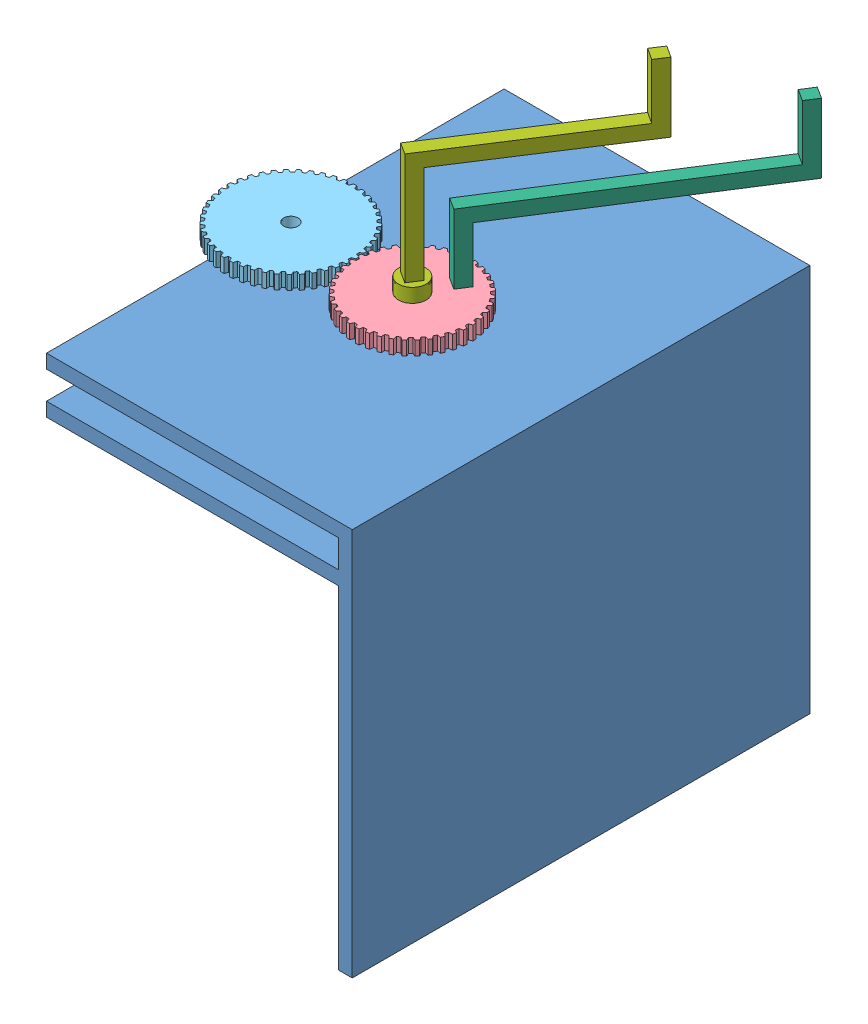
SolidWorks assembly Spinningmech2.SLDASM, configuration Default (file format 4700). Lengths in mm.
Overall size (80 133.5 108.74).
8 component instances, 8 part files, 12 mates.
Components (placement in the parent):
- spinningsupport-1: spinningsupport.SLDPRT [Default] at (-0.3739 -15.4282 10.679) size (70.01 88.9 104.78)
- gear 1-1: gear 1.SLDPRT [Default] at (-0.3739 67.1218 10.679) x (1 0 0) z (0 -1 0) size (38.08 38.08 3.17)
- gear 2-1: gear 2.SLDPRT [Default] at (-28.1742 67.1218 10.679) x (0 -1 0) z (0 0 1) size (3.17 16.75 16.78)
- gear 3-1: gear 3.SLDPRT [Default] at (-0.3739 76.6468 10.679) x (0 -1 0) z (-0.537739 0 0.843112) size (3.17 26.92 26.92)
- gear 4-1: gear 4.SLDPRT [Default] at (-28.1742 73.4718 10.679) size (29.47 3.17 29.45)
- scholarship-1: scholarship.SLDPRT [Default] at (3.3376 77.15 1.4585) x (0.843112 0 0.537739) z (-0.537739 0 0.843112) size (3.17 28.57 60.96)
- dude2-1: dude2.SLDPRT [Default] at (-0.8432 79.8218 8.4835) x (0.543663 0 -0.839303) z (0.839303 0 0.543663) size (45.65 41.43 6.35)
- Spinningshaft-1: Spinningshaft.SLDPRT [Default] at (-0.3739 -15.4282 10.679) size (6.35 76.2 6.35)
Mates (geometry in assembly coordinates):
- Concentric1: concentric anti-aligned: circle of spinningsupport-1; circle of gear 1-1
- Coincident1: coincident anti-aligned: plane of spinningsupport-1 through (-33.3348 63.9468 61.479) normal (0 1 0); plane of gear 1-1 through (-0.3739 63.9468 10.679) normal (0 -1 0)
- Concentric2: concentric anti-aligned: circle of spinningsupport-1; circle of gear 2-1
- Coincident2: coincident anti-aligned: plane of spinningsupport-1 through (-33.3348 63.9468 61.479) normal (0 1 0); plane of gear 2-1 through (-28.1742 63.9468 10.679) normal (0 -1 0)
- Concentric3: concentric aligned: circle of spinningsupport-1; circle of gear 4-1
- Coincident3: coincident anti-aligned: plane of spinningsupport-1 through (-33.3348 73.4718 61.479) normal (0 1 0); plane of gear 4-1 through (-28.1742 73.4718 10.679) normal (0 -1 0)
- Concentric4: concentric anti-aligned: circle of spinningsupport-1; circle of gear 3-1
- Coincident4: coincident anti-aligned: plane of spinningsupport-1 through (-33.3348 73.4718 61.479) normal (0 1 0); plane of gear 3-1 through (-0.3739 73.4718 10.679) normal (0 -1 0)
- Coincident5: coincident aligned: circle of gear 3-1; plane of dude2-1 through (-0.3739 76.6468 10.679) normal (0 -1 0)
- Concentric5: concentric aligned: circle of gear 3-1; circle of dude2-1
- Lock1: lock: unknown of ?; unknown of ?
- Coincident7: coincident aligned: circle of spinningsupport-1; circle of Spinningshaft-1
